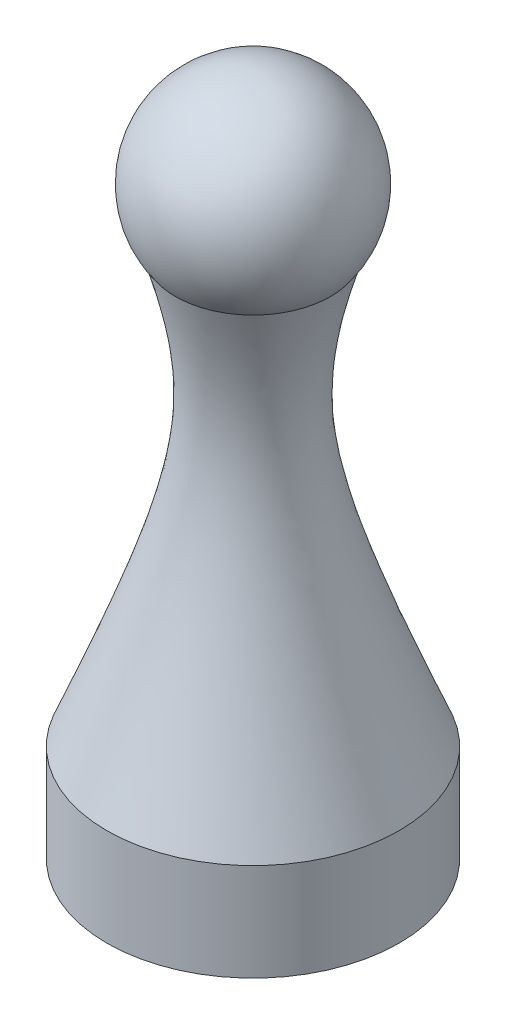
ISO-10303-21;
HEADER;
FILE_DESCRIPTION(('STEP AP214'),'2;1');
FILE_NAME('part.step','',(''),(''),'','','');
FILE_SCHEMA(('AUTOMOTIVE_DESIGN { 1 0 10303 214 1 1 1 1 }'));
ENDSEC;
DATA;
#1=APPLICATION_CONTEXT('core data for automotive mechanical design processes');
#2=APPLICATION_PROTOCOL_DEFINITION('international standard','automotive_design',2000,#1);
#3=PRODUCT_CONTEXT('',#1,'mechanical');
#4=PRODUCT('Part','Part','',(#3));
#5=PRODUCT_RELATED_PRODUCT_CATEGORY('part','',(#4));
#6=PRODUCT_DEFINITION_FORMATION('','',#4);
#7=PRODUCT_DEFINITION_CONTEXT('part definition',#1,'design');
#8=PRODUCT_DEFINITION('design','',#6,#7);
#9=PRODUCT_DEFINITION_SHAPE('','',#8);
#10=(LENGTH_UNIT() NAMED_UNIT(*) SI_UNIT(.MILLI.,.METRE.));
#11=(NAMED_UNIT(*) PLANE_ANGLE_UNIT() SI_UNIT($,.RADIAN.));
#12=(NAMED_UNIT(*) SI_UNIT($,.STERADIAN.) SOLID_ANGLE_UNIT());
#13=UNCERTAINTY_MEASURE_WITH_UNIT(LENGTH_MEASURE(1.E-05),#10,'distance_accuracy_value','');
#14=(GEOMETRIC_REPRESENTATION_CONTEXT(3) GLOBAL_UNCERTAINTY_ASSIGNED_CONTEXT((#13)) GLOBAL_UNIT_ASSIGNED_CONTEXT((#10,
#11,#12)) REPRESENTATION_CONTEXT('',''));
#15=CARTESIAN_POINT('',(0.,0.,0.));
#16=DIRECTION('',(0.,0.,1.));
#17=DIRECTION('',(1.,0.,0.));
#18=AXIS2_PLACEMENT_3D('',#15,#16,#17);
#19=CARTESIAN_POINT('',(-8.44327925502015,60.,-5.35826794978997));
#20=CARTESIAN_POINT('',(0.,10.,15.));
#21=CARTESIAN_POINT('',(2.27325664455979,60.,-22.2448264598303));
#22=CARTESIAN_POINT('',(-30.,10.,15.));
#23=CARTESIAN_POINT('',(19.1598151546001,60.,-11.5282905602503));
#24=CARTESIAN_POINT('',(-30.,10.,-15.));
#25=CARTESIAN_POINT('',(8.44327925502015,60.,5.35826794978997));
#26=CARTESIAN_POINT('',(0.,10.,-15.));
#27=CARTESIAN_POINT('',(-2.27325664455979,60.,22.2448264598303));
#28=CARTESIAN_POINT('',(30.,10.,-15.));
#29=CARTESIAN_POINT('',(-19.1598151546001,60.,11.5282905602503));
#30=CARTESIAN_POINT('',(30.,10.,15.));
#31=CARTESIAN_POINT('',(-8.44327925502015,60.,-5.35826794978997));
#32=CARTESIAN_POINT('',(0.,10.,15.));
#33=(BOUNDED_SURFACE() B_SPLINE_SURFACE(3,1,((#19,#20),(#21,#22),(#23,#24),(#25,#26),(#27,#28),
(#29,#30),(#31,#32)),.UNSPECIFIED.,.T.,.F.,.F.) B_SPLINE_SURFACE_WITH_KNOTS((4,3,4),(2,2),(0.,
0.5,1.),(0.,1.),.UNSPECIFIED.) GEOMETRIC_REPRESENTATION_ITEM() RATIONAL_B_SPLINE_SURFACE(((1.,
1.),(0.333333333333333,0.333333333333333),(0.333333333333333,0.333333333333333),(1.,1.),
(0.333333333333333,0.333333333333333),(0.333333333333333,0.333333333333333),(1.,1.))) REPRESENTATION_ITEM('') SURFACE());
#34=CARTESIAN_POINT('',(0.,10.,0.));
#35=DIRECTION('',(0.,-1.,0.));
#36=DIRECTION('',(0.,0.,-1.));
#37=AXIS2_PLACEMENT_3D('',#34,#35,#36);
#38=CIRCLE('',#37,15.);
#39=CARTESIAN_POINT('',(0.,10.,15.));
#40=VERTEX_POINT('',#39);
#41=EDGE_CURVE('E12',#40,#40,#38,.F.);
#42=CARTESIAN_POINT('',(0.,53.9588331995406,0.));
#43=DIRECTION('',(0.,-1.,0.));
#44=DIRECTION('',(0.,0.,-1.));
#45=AXIS2_PLACEMENT_3D('',#42,#43,#44);
#46=CIRCLE('',#45,7.9689587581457);
#47=CARTESIAN_POINT('',(-7.42313408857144,53.9588331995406,-2.89851410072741));
#48=VERTEX_POINT('',#47);
#49=EDGE_CURVE('E165',#48,#48,#46,.T.);
#50=CARTESIAN_POINT('',(0.,10.,15.));
#51=CARTESIAN_POINT('',(-0.0773243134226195,10.4579045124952,14.8135571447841));
#52=CARTESIAN_POINT('',(-0.154648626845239,10.9158090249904,14.6271142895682));
#53=CARTESIAN_POINT('',(-0.309297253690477,11.8316180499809,14.2542285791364));
#54=CARTESIAN_POINT('',(-0.386621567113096,12.2895225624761,14.0677857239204));
#55=CARTESIAN_POINT('',(-0.541270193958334,13.2053315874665,13.6949000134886));
#56=CARTESIAN_POINT('',(-0.618594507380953,13.6632360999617,13.5084571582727));
#57=CARTESIAN_POINT('',(-0.773243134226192,14.5790451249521,13.1355714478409));
#58=CARTESIAN_POINT('',(-0.850567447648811,15.0369496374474,12.949128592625));
#59=CARTESIAN_POINT('',(-1.00521607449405,15.9527586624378,12.5762428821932));
#60=CARTESIAN_POINT('',(-1.08254038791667,16.410663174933,12.3898000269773));
#61=CARTESIAN_POINT('',(-1.23718901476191,17.3264721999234,12.0169143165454));
#62=CARTESIAN_POINT('',(-1.31451332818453,17.7843767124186,11.8304714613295));
#63=CARTESIAN_POINT('',(-1.46916195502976,18.7001857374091,11.4575857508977));
#64=CARTESIAN_POINT('',(-1.54648626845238,19.1580902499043,11.2711428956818));
#65=CARTESIAN_POINT('',(-1.70113489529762,20.0738992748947,10.89825718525));
#66=CARTESIAN_POINT('',(-1.77845920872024,20.5318037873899,10.7118143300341));
#67=CARTESIAN_POINT('',(-1.93310783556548,21.4476128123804,10.3389286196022));
#68=CARTESIAN_POINT('',(-2.0104321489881,21.9055173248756,10.1524857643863));
#69=CARTESIAN_POINT('',(-2.16508077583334,22.821326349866,9.77960005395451));
#70=CARTESIAN_POINT('',(-2.24240508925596,23.2792308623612,9.5931571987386));
#71=CARTESIAN_POINT('',(-2.39705371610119,24.1950398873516,9.22027148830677));
#72=CARTESIAN_POINT('',(-2.47437802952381,24.6529443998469,9.03382863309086));
#73=CARTESIAN_POINT('',(-2.62902665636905,25.5687534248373,8.66094292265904));
#74=CARTESIAN_POINT('',(-2.70635096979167,26.0266579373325,8.47450006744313));
#75=CARTESIAN_POINT('',(-2.86099959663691,26.9424669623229,8.10161435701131));
#76=CARTESIAN_POINT('',(-2.93832391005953,27.4003714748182,7.9151715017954));
#77=CARTESIAN_POINT('',(-3.09297253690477,28.3161804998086,7.54228579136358));
#78=CARTESIAN_POINT('',(-3.17029685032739,28.7740850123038,7.35584293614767));
#79=CARTESIAN_POINT('',(-3.32494547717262,29.6898940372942,6.98295722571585));
#80=CARTESIAN_POINT('',(-3.40226979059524,30.1477985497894,6.79651437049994));
#81=CARTESIAN_POINT('',(-3.55691841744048,31.0636075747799,6.42362866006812));
#82=CARTESIAN_POINT('',(-3.6342427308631,31.5215120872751,6.2371858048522));
#83=CARTESIAN_POINT('',(-3.78889135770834,32.4373211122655,5.86430009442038));
#84=CARTESIAN_POINT('',(-3.86621567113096,32.8952256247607,5.67785723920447));
#85=CARTESIAN_POINT('',(-4.0208642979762,33.8110346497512,5.30497152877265));
#86=CARTESIAN_POINT('',(-4.09818861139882,34.2689391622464,5.11852867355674));
#87=CARTESIAN_POINT('',(-4.25283723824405,35.1847481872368,4.74564296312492));
#88=CARTESIAN_POINT('',(-4.33016155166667,35.642652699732,4.55920010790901));
#89=CARTESIAN_POINT('',(-4.48481017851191,36.5584617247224,4.18631439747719));
#90=CARTESIAN_POINT('',(-4.56213449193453,37.0163662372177,3.99987154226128));
#91=CARTESIAN_POINT('',(-4.71678311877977,37.9321752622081,3.62698583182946));
#92=CARTESIAN_POINT('',(-4.79410743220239,38.3900797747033,3.44054297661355));
#93=CARTESIAN_POINT('',(-4.94875605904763,39.3058887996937,3.06765726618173));
#94=CARTESIAN_POINT('',(-5.02608037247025,39.7637933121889,2.88121441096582));
#95=CARTESIAN_POINT('',(-5.18072899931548,40.6796023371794,2.50832870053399));
#96=CARTESIAN_POINT('',(-5.2580533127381,41.1375068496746,2.32188584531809));
#97=CARTESIAN_POINT('',(-5.41270193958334,42.053315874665,1.94900013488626));
#98=CARTESIAN_POINT('',(-5.49002625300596,42.5112203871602,1.76255727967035));
#99=CARTESIAN_POINT('',(-5.6446748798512,43.4270294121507,1.38967156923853));
#100=CARTESIAN_POINT('',(-5.72199919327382,43.8849339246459,1.20322871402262));
#101=CARTESIAN_POINT('',(-5.87664782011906,44.8007429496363,0.8303430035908));
#102=CARTESIAN_POINT('',(-5.95397213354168,45.2586474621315,0.643900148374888));
#103=CARTESIAN_POINT('',(-6.10862076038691,46.1744564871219,0.271014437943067));
#104=CARTESIAN_POINT('',(-6.18594507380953,46.6323609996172,0.0845715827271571));
#105=CARTESIAN_POINT('',(-6.34059370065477,47.5481700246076,-0.288314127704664));
#106=CARTESIAN_POINT('',(-6.41791801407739,48.0060745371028,-0.474756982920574));
#107=CARTESIAN_POINT('',(-6.57256664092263,48.9218835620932,-0.847642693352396));
#108=CARTESIAN_POINT('',(-6.64989095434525,49.3797880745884,-1.03408554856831));
#109=CARTESIAN_POINT('',(-6.80453958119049,50.2955970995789,-1.40697125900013));
#110=CARTESIAN_POINT('',(-6.88186389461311,50.7535016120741,-1.59341411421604));
#111=CARTESIAN_POINT('',(-7.03651252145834,51.6693106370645,-1.96629982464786));
#112=CARTESIAN_POINT('',(-7.11383683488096,52.1272151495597,-2.15274267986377));
#113=CARTESIAN_POINT('',(-7.2684854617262,53.0430241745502,-2.52562839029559));
#114=CARTESIAN_POINT('',(-7.34580977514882,53.5009286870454,-2.7120712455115));
#115=CARTESIAN_POINT('',(-7.42313408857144,53.9588331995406,-2.89851410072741));
#116=B_SPLINE_CURVE_WITH_KNOTS('',3,(#50,#51,#52,#53,#54,#55,#56,#57,#58,#59,#60,#61,#62,#63,
#64,#65,#66,#67,#68,#69,#70,#71,#72,#73,#74,#75,#76,#77,#78,#79,#80,#81,#82,#83,#84,#85,#86,#87,
#88,#89,#90,#91,#92,#93,#94,#95,#96,#97,#98,#99,#100,#101,#102,#103,#104,#105,#106,#107,#108,
#109,#110,#111,#112,#113,#114,#115),.UNSPECIFIED.,.F.,.F.,(4,2,2,2,2,2,2,2,2,2,2,2,2,2,2,2,2,2,
2,2,2,2,2,2,2,2,2,2,2,2,2,2,4),(0.,1.50124907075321,3.00249814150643,4.50374721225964,
6.00499628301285,7.50624535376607,9.00749442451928,10.5087434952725,12.0099925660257,
13.5112416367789,15.0124907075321,16.5137397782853,18.0149888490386,19.5162379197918,
21.017486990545,22.5187360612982,24.0199851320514,25.5212342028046,27.0224832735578,
28.523732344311,30.0249814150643,31.5262304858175,33.0274795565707,34.5287286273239,
36.0299776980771,37.5312267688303,39.0324758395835,40.5337249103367,42.0349739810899,
43.5362230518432,45.0374721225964,46.5387211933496,48.0399702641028),.UNSPECIFIED.);
#117=EDGE_CURVE('BSEAM161',#40,#48,#116,.T.);
#118=ORIENTED_EDGE('',*,*,#41,.T.);
#119=ORIENTED_EDGE('',*,*,#49,.T.);
#120=ORIENTED_EDGE('',*,*,#117,.T.);
#121=ORIENTED_EDGE('',*,*,#117,.F.);
#122=EDGE_LOOP('',(#118,#120,#119,#121));
#123=FACE_BOUND('',#122,.T.);
#124=ADVANCED_FACE('F161',(#123),#33,.T.);
#125=CARTESIAN_POINT('',(0.,10.,0.));
#126=DIRECTION('',(0.,-1.,0.));
#127=DIRECTION('',(0.,0.,-1.));
#128=AXIS2_PLACEMENT_3D('',#125,#126,#127);
#129=CYLINDRICAL_SURFACE('',#128,15.);
#130=ORIENTED_EDGE('',*,*,#41,.F.);
#131=EDGE_LOOP('',(#130));
#132=FACE_BOUND('',#131,.T.);
#133=CARTESIAN_POINT('',(0.,0.,0.));
#134=DIRECTION('',(0.,1.,0.));
#135=DIRECTION('',(0.,0.,1.));
#136=AXIS2_PLACEMENT_3D('',#133,#134,#135);
#137=CIRCLE('',#136,15.);
#138=CARTESIAN_POINT('',(0.,0.,15.));
#139=VERTEX_POINT('',#138);
#140=EDGE_CURVE('E170',#139,#139,#137,.T.);
#141=ORIENTED_EDGE('',*,*,#140,.T.);
#142=EDGE_LOOP('',(#141));
#143=FACE_BOUND('',#142,.T.);
#144=ADVANCED_FACE('F163',(#132,#143),#129,.T.);
#145=CARTESIAN_POINT('',(0.,0.,0.));
#146=DIRECTION('',(0.,1.,0.));
#147=DIRECTION('',(0.,0.,1.));
#148=AXIS2_PLACEMENT_3D('',#145,#146,#147);
#149=PLANE('',#148);
#150=DIRECTION('',(-0.365433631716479,0.,-0.93083739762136));
#151=VECTOR('',#150,1.);
#152=CARTESIAN_POINT('',(-3.84697849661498,0.,1.51026949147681));
#153=LINE('',#152,#151);
#154=CARTESIAN_POINT('',(-0.950626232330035,0.,8.88789642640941));
#155=VERTEX_POINT('',#154);
#156=CARTESIAN_POINT('',(-5.20694869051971,0.,-1.95386463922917));
#157=VERTEX_POINT('',#156);
#158=EDGE_CURVE('E403',#155,#157,#153,.T.);
#159=ORIENTED_EDGE('',*,*,#158,.F.);
#160=CARTESIAN_POINT('',(-1.4866757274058,0.,2.65930278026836));
#161=DIRECTION('',(0.,-1.,0.));
#162=DIRECTION('',(0.,0.,-1.));
#163=AXIS2_PLACEMENT_3D('',#160,#161,#162);
#164=CIRCLE('',#163,6.25161802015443);
#165=CARTESIAN_POINT('',(-7.72804018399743,0.,2.30139554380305));
#166=VERTEX_POINT('',#165);
#167=EDGE_CURVE('E401',#155,#166,#164,.F.);
#168=ORIENTED_EDGE('',*,*,#167,.T.);
#169=CARTESIAN_POINT('',(-1.77371629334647,0.,2.95466336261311));
#170=DIRECTION('',(0.,-1.,0.));
#171=DIRECTION('',(0.,0.,-1.));
#172=AXIS2_PLACEMENT_3D('',#169,#170,#171);
#173=CIRCLE('',#172,5.99005274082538);
#174=EDGE_CURVE('E370',#157,#166,#173,.F.);
#175=ORIENTED_EDGE('',*,*,#174,.F.);
#176=EDGE_LOOP('',(#159,#168,#175));
#177=FACE_BOUND('',#176,.T.);
#178=CARTESIAN_POINT('',(-0.842610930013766,0.,2.13445317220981));
#179=DIRECTION('',(0.,-1.,0.));
#180=DIRECTION('',(0.,0.,-1.));
#181=AXIS2_PLACEMENT_3D('',#178,#179,#180);
#182=CIRCLE('',#181,7.17483581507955);
#183=CARTESIAN_POINT('',(0.151933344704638,0.,9.2400249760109));
#184=VERTEX_POINT('',#183);
#185=CARTESIAN_POINT('',(-7.72804018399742,0.,0.117243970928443));
#186=VERTEX_POINT('',#185);
#187=EDGE_CURVE('E463',#184,#186,#182,.F.);
#188=ORIENTED_EDGE('',*,*,#187,.F.);
#189=CARTESIAN_POINT('',(0.783534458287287,0.,0.729839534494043));
#190=DIRECTION('',(0.,-1.,0.));
#191=DIRECTION('',(0.,0.,-1.));
#192=AXIS2_PLACEMENT_3D('',#189,#190,#191);
#193=CIRCLE('',#192,8.53359105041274);
#194=CARTESIAN_POINT('',(6.33222488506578,0.,-5.75354004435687));
#195=VERTEX_POINT('',#194);
#196=EDGE_CURVE('E416',#184,#195,#193,.F.);
#197=ORIENTED_EDGE('',*,*,#196,.T.);
#198=DIRECTION('',(-0.842101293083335,0.,0.539319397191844));
#199=VECTOR('',#198,1.);
#200=CARTESIAN_POINT('',(-0.771211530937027,0.,-1.20418110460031));
#201=LINE('',#200,#199);
#202=CARTESIAN_POINT('',(8.83526426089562,0.,-7.3565986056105));
#203=VERTEX_POINT('',#202);
#204=EDGE_CURVE('E437',#203,#195,#201,.T.);
#205=ORIENTED_EDGE('',*,*,#204,.F.);
#206=DIRECTION('',(0.,0.,1.));
#207=VECTOR('',#206,1.);
#208=CARTESIAN_POINT('',(8.83526426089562,0.,0.));
#209=LINE('',#208,#207);
#210=CARTESIAN_POINT('',(8.83526426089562,0.,-7.80361311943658));
#211=VERTEX_POINT('',#210);
#212=EDGE_CURVE('E492',#211,#203,#209,.T.);
#213=ORIENTED_EDGE('',*,*,#212,.F.);
#214=DIRECTION('',(1.,0.,0.));
#215=VECTOR('',#214,1.);
#216=CARTESIAN_POINT('',(0.,0.,-7.80361311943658));
#217=LINE('',#216,#215);
#218=CARTESIAN_POINT('',(4.39823128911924,0.,-7.80361311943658));
#219=VERTEX_POINT('',#218);
#220=EDGE_CURVE('E489',#219,#211,#217,.T.);
#221=ORIENTED_EDGE('',*,*,#220,.F.);
#222=DIRECTION('',(-0.205904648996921,0.,-0.978572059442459));
#223=VECTOR('',#222,1.);
#224=CARTESIAN_POINT('',(5.7841304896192,0.,-1.21705841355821));
#225=LINE('',#224,#223);
#226=CARTESIAN_POINT('',(4.58634695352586,0.,-6.90958409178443));
#227=VERTEX_POINT('',#226);
#228=EDGE_CURVE('E486',#227,#219,#225,.T.);
#229=ORIENTED_EDGE('',*,*,#228,.F.);
#230=CARTESIAN_POINT('',(-3.65651739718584,0.,-6.55769199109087));
#231=VERTEX_POINT('',#230);
#232=EDGE_CURVE('E464',#227,#231,#193,.F.);
#233=ORIENTED_EDGE('',*,*,#232,.T.);
#234=DIRECTION('',(0.110212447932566,0.,0.993908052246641));
#235=VECTOR('',#234,1.);
#236=CARTESIAN_POINT('',(-2.89376607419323,0.,0.32088385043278));
#237=LINE('',#236,#235);
#238=CARTESIAN_POINT('',(-3.7830585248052,0.,-7.69885388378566));
#239=VERTEX_POINT('',#238);
#240=EDGE_CURVE('E483',#239,#231,#237,.T.);
#241=ORIENTED_EDGE('',*,*,#240,.F.);
#242=DIRECTION('',(0.,0.,1.));
#243=VECTOR('',#242,1.);
#244=CARTESIAN_POINT('',(-3.7830585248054,0.,0.));
#245=LINE('',#244,#243);
#246=CARTESIAN_POINT('',(-3.78305852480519,0.,-7.93892706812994));
#247=VERTEX_POINT('',#246);
#248=EDGE_CURVE('E480',#247,#239,#245,.T.);
#249=ORIENTED_EDGE('',*,*,#248,.F.);
#250=DIRECTION('',(1.,0.,0.));
#251=VECTOR('',#250,1.);
#252=CARTESIAN_POINT('',(0.,0.,-7.93892706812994));
#253=LINE('',#252,#251);
#254=CARTESIAN_POINT('',(-9.12138739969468,0.,-7.93892706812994));
#255=VERTEX_POINT('',#254);
#256=EDGE_CURVE('E477',#255,#247,#253,.T.);
#257=ORIENTED_EDGE('',*,*,#256,.F.);
#258=DIRECTION('',(0.,0.,-1.));
#259=VECTOR('',#258,1.);
#260=CARTESIAN_POINT('',(-9.12138739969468,0.,0.));
#261=LINE('',#260,#259);
#262=CARTESIAN_POINT('',(-9.12138739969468,0.,-7.45839873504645));
#263=VERTEX_POINT('',#262);
#264=EDGE_CURVE('E474',#263,#255,#261,.T.);
#265=ORIENTED_EDGE('',*,*,#264,.F.);
#266=DIRECTION('',(-0.793878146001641,0.,-0.60807687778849));
#267=VECTOR('',#266,1.);
#268=CARTESIAN_POINT('',(0.227758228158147,0.,-0.29735102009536));
#269=LINE('',#268,#267);
#270=CARTESIAN_POINT('',(-6.61395636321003,0.,-5.53781326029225));
#271=VERTEX_POINT('',#270);
#272=EDGE_CURVE('E471',#271,#263,#269,.T.);
#273=ORIENTED_EDGE('',*,*,#272,.F.);
#274=DIRECTION('',(-0.365433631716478,0.,-0.93083739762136));
#275=VECTOR('',#274,1.);
#276=CARTESIAN_POINT('',(-3.84697849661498,0.,1.51026949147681));
#277=LINE('',#276,#275);
#278=CARTESIAN_POINT('',(-6.12175120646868,0.,-4.28406175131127));
#279=VERTEX_POINT('',#278);
#280=EDGE_CURVE('E468',#279,#271,#277,.T.);
#281=ORIENTED_EDGE('',*,*,#280,.F.);
#282=EDGE_CURVE('E465',#279,#186,#193,.F.);
#283=ORIENTED_EDGE('',*,*,#282,.T.);
#284=EDGE_LOOP('',(#188,#197,#205,#213,#221,#229,#233,#241,#249,#257,#265,#273,#281,#283));
#285=FACE_BOUND('',#284,.T.);
#286=ORIENTED_EDGE('',*,*,#140,.F.);
#287=EDGE_LOOP('',(#286));
#288=FACE_BOUND('',#287,.T.);
#289=ADVANCED_FACE('F549',(#177,#285,#288),#149,.F.);
#290=CARTESIAN_POINT('',(0.,60.,0.));
#291=DIRECTION('',(0.,0.,-1.));
#292=DIRECTION('',(1.,0.,0.));
#293=AXIS2_PLACEMENT_3D('',#290,#291,#292);
#294=SPHERICAL_SURFACE('',#293,10.);
#295=CARTESIAN_POINT('',(0.,60.,0.));
#296=DIRECTION('',(0.,-1.,0.));
#297=DIRECTION('',(0.,0.,-1.));
#298=AXIS2_PLACEMENT_3D('',#295,#296,#297);
#299=SPHERICAL_SURFACE('',#298,10.);
#300=ORIENTED_EDGE('',*,*,#49,.F.);
#301=EDGE_LOOP('',(#300));
#302=FACE_BOUND('',#301,.T.);
#303=ADVANCED_FACE('F546',(#302),#299,.T.);
#304=CARTESIAN_POINT('',(0.783534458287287,-2.,0.729839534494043));
#305=DIRECTION('',(0.,1.,0.));
#306=DIRECTION('',(0.,0.,1.));
#307=AXIS2_PLACEMENT_3D('',#304,#305,#306);
#308=CYLINDRICAL_SURFACE('',#307,8.53359105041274);
#309=ORIENTED_EDGE('',*,*,#196,.F.);
#310=DIRECTION('',(0.,1.,0.));
#311=VECTOR('',#310,1.);
#312=CARTESIAN_POINT('',(0.151933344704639,-2.,9.2400249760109));
#313=LINE('',#312,#311);
#314=CARTESIAN_POINT('',(0.151933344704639,-2.,9.2400249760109));
#315=VERTEX_POINT('',#314);
#316=EDGE_CURVE('E535',#315,#184,#313,.T.);
#317=ORIENTED_EDGE('',*,*,#316,.F.);
#318=CARTESIAN_POINT('',(0.783534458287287,-2.,0.729839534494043));
#319=DIRECTION('',(0.,-1.,0.));
#320=DIRECTION('',(0.,0.,-1.));
#321=AXIS2_PLACEMENT_3D('',#318,#319,#320);
#322=CIRCLE('',#321,8.53359105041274);
#323=CARTESIAN_POINT('',(6.33222488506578,-2.,-5.75354004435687));
#324=VERTEX_POINT('',#323);
#325=EDGE_CURVE('E433',#315,#324,#322,.F.);
#326=ORIENTED_EDGE('',*,*,#325,.T.);
#327=DIRECTION('',(0.,1.,0.));
#328=VECTOR('',#327,1.);
#329=CARTESIAN_POINT('',(6.33222488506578,-2.,-5.75354004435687));
#330=LINE('',#329,#328);
#331=EDGE_CURVE('E461',#324,#195,#330,.T.);
#332=ORIENTED_EDGE('',*,*,#331,.T.);
#333=EDGE_LOOP('',(#309,#317,#326,#332));
#334=FACE_BOUND('',#333,.T.);
#335=ADVANCED_FACE('F548',(#334),#308,.T.);
#336=CARTESIAN_POINT('',(-0.842610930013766,-2.,2.13445317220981));
#337=DIRECTION('',(0.,1.,0.));
#338=DIRECTION('',(0.,0.,1.));
#339=AXIS2_PLACEMENT_3D('',#336,#337,#338);
#340=CYLINDRICAL_SURFACE('',#339,7.17483581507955);
#341=ORIENTED_EDGE('',*,*,#187,.T.);
#342=DIRECTION('',(0.,1.,0.));
#343=VECTOR('',#342,1.);
#344=CARTESIAN_POINT('',(-7.72804018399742,-2.,0.117243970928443));
#345=LINE('',#344,#343);
#346=CARTESIAN_POINT('',(-7.72804018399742,-2.,0.117243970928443));
#347=VERTEX_POINT('',#346);
#348=EDGE_CURVE('E532',#347,#186,#345,.T.);
#349=ORIENTED_EDGE('',*,*,#348,.F.);
#350=CARTESIAN_POINT('',(-0.842610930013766,-2.,2.13445317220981));
#351=DIRECTION('',(0.,-1.,0.));
#352=DIRECTION('',(0.,0.,-1.));
#353=AXIS2_PLACEMENT_3D('',#350,#351,#352);
#354=CIRCLE('',#353,7.17483581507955);
#355=EDGE_CURVE('E436',#315,#347,#354,.F.);
#356=ORIENTED_EDGE('',*,*,#355,.F.);
#357=ORIENTED_EDGE('',*,*,#316,.T.);
#358=EDGE_LOOP('',(#341,#349,#356,#357));
#359=FACE_BOUND('',#358,.T.);
#360=ADVANCED_FACE('F556',(#359),#340,.F.);
#361=ORIENTED_EDGE('',*,*,#282,.F.);
#362=DIRECTION('',(0.,1.,0.));
#363=VECTOR('',#362,1.);
#364=CARTESIAN_POINT('',(-6.12175120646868,-2.,-4.28406175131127));
#365=LINE('',#364,#363);
#366=CARTESIAN_POINT('',(-6.12175120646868,-2.,-4.28406175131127));
#367=VERTEX_POINT('',#366);
#368=EDGE_CURVE('E529',#367,#279,#365,.T.);
#369=ORIENTED_EDGE('',*,*,#368,.F.);
#370=EDGE_CURVE('E439',#367,#347,#322,.F.);
#371=ORIENTED_EDGE('',*,*,#370,.T.);
#372=ORIENTED_EDGE('',*,*,#348,.T.);
#373=EDGE_LOOP('',(#361,#369,#371,#372));
#374=FACE_BOUND('',#373,.T.);
#375=ADVANCED_FACE('F559',(#374),#308,.T.);
#376=CARTESIAN_POINT('',(-3.84697849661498,-2.,1.51026949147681));
#377=DIRECTION('',(0.93083739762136,0.,-0.365433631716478));
#378=DIRECTION('',(-0.365433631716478,0.,-0.93083739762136));
#379=AXIS2_PLACEMENT_3D('',#376,#377,#378);
#380=PLANE('',#379);
#381=ORIENTED_EDGE('',*,*,#280,.T.);
#382=DIRECTION('',(0.,1.,0.));
#383=VECTOR('',#382,1.);
#384=CARTESIAN_POINT('',(-6.61395636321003,-2.,-5.53781326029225));
#385=LINE('',#384,#383);
#386=CARTESIAN_POINT('',(-6.61395636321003,-2.,-5.53781326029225));
#387=VERTEX_POINT('',#386);
#388=EDGE_CURVE('E526',#387,#271,#385,.T.);
#389=ORIENTED_EDGE('',*,*,#388,.F.);
#390=DIRECTION('',(-0.365433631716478,0.,-0.93083739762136));
#391=VECTOR('',#390,1.);
#392=CARTESIAN_POINT('',(-3.84697849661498,-2.,1.51026949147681));
#393=LINE('',#392,#391);
#394=EDGE_CURVE('E441',#367,#387,#393,.T.);
#395=ORIENTED_EDGE('',*,*,#394,.F.);
#396=ORIENTED_EDGE('',*,*,#368,.T.);
#397=EDGE_LOOP('',(#381,#389,#395,#396));
#398=FACE_BOUND('',#397,.T.);
#399=ADVANCED_FACE('F617',(#398),#380,.F.);
#400=CARTESIAN_POINT('',(0.227758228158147,-2.,-0.29735102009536));
#401=DIRECTION('',(0.60807687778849,0.,-0.793878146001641));
#402=DIRECTION('',(-0.793878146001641,0.,-0.60807687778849));
#403=AXIS2_PLACEMENT_3D('',#400,#401,#402);
#404=PLANE('',#403);
#405=ORIENTED_EDGE('',*,*,#272,.T.);
#406=DIRECTION('',(0.,1.,0.));
#407=VECTOR('',#406,1.);
#408=CARTESIAN_POINT('',(-9.12138739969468,-2.,-7.45839873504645));
#409=LINE('',#408,#407);
#410=CARTESIAN_POINT('',(-9.12138739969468,-2.,-7.45839873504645));
#411=VERTEX_POINT('',#410);
#412=EDGE_CURVE('E523',#411,#263,#409,.T.);
#413=ORIENTED_EDGE('',*,*,#412,.F.);
#414=DIRECTION('',(-0.793878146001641,0.,-0.60807687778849));
#415=VECTOR('',#414,1.);
#416=CARTESIAN_POINT('',(0.227758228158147,-2.,-0.29735102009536));
#417=LINE('',#416,#415);
#418=EDGE_CURVE('E443',#387,#411,#417,.T.);
#419=ORIENTED_EDGE('',*,*,#418,.F.);
#420=ORIENTED_EDGE('',*,*,#388,.T.);
#421=EDGE_LOOP('',(#405,#413,#419,#420));
#422=FACE_BOUND('',#421,.T.);
#423=ADVANCED_FACE('F627',(#422),#404,.F.);
#424=CARTESIAN_POINT('',(-9.12138739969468,-2.,0.));
#425=DIRECTION('',(1.,0.,0.));
#426=DIRECTION('',(0.,0.,-1.));
#427=AXIS2_PLACEMENT_3D('',#424,#425,#426);
#428=PLANE('',#427);
#429=ORIENTED_EDGE('',*,*,#264,.T.);
#430=DIRECTION('',(0.,1.,0.));
#431=VECTOR('',#430,1.);
#432=CARTESIAN_POINT('',(-9.12138739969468,-2.,-7.93892706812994));
#433=LINE('',#432,#431);
#434=CARTESIAN_POINT('',(-9.12138739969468,-2.,-7.93892706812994));
#435=VERTEX_POINT('',#434);
#436=EDGE_CURVE('E520',#435,#255,#433,.T.);
#437=ORIENTED_EDGE('',*,*,#436,.F.);
#438=DIRECTION('',(0.,0.,-1.));
#439=VECTOR('',#438,1.);
#440=CARTESIAN_POINT('',(-9.12138739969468,-2.,0.));
#441=LINE('',#440,#439);
#442=EDGE_CURVE('E445',#411,#435,#441,.T.);
#443=ORIENTED_EDGE('',*,*,#442,.F.);
#444=ORIENTED_EDGE('',*,*,#412,.T.);
#445=EDGE_LOOP('',(#429,#437,#443,#444));
#446=FACE_BOUND('',#445,.T.);
#447=ADVANCED_FACE('F638',(#446),#428,.F.);
#448=CARTESIAN_POINT('',(0.,-2.,-7.93892706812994));
#449=DIRECTION('',(0.,0.,1.));
#450=DIRECTION('',(1.,0.,0.));
#451=AXIS2_PLACEMENT_3D('',#448,#449,#450);
#452=PLANE('',#451);
#453=ORIENTED_EDGE('',*,*,#256,.T.);
#454=DIRECTION('',(0.,1.,0.));
#455=VECTOR('',#454,1.);
#456=CARTESIAN_POINT('',(-3.78305852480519,-2.,-7.93892706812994));
#457=LINE('',#456,#455);
#458=CARTESIAN_POINT('',(-3.78305852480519,-2.,-7.93892706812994));
#459=VERTEX_POINT('',#458);
#460=EDGE_CURVE('E517',#459,#247,#457,.T.);
#461=ORIENTED_EDGE('',*,*,#460,.F.);
#462=DIRECTION('',(1.,0.,0.));
#463=VECTOR('',#462,1.);
#464=CARTESIAN_POINT('',(0.,-2.,-7.93892706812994));
#465=LINE('',#464,#463);
#466=EDGE_CURVE('E447',#435,#459,#465,.T.);
#467=ORIENTED_EDGE('',*,*,#466,.F.);
#468=ORIENTED_EDGE('',*,*,#436,.T.);
#469=EDGE_LOOP('',(#453,#461,#467,#468));
#470=FACE_BOUND('',#469,.T.);
#471=ADVANCED_FACE('F649',(#470),#452,.F.);
#472=CARTESIAN_POINT('',(-3.7830585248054,-2.,0.));
#473=DIRECTION('',(-1.,0.,0.));
#474=DIRECTION('',(0.,0.,1.));
#475=AXIS2_PLACEMENT_3D('',#472,#473,#474);
#476=PLANE('',#475);
#477=ORIENTED_EDGE('',*,*,#248,.T.);
#478=DIRECTION('',(0.,1.,0.));
#479=VECTOR('',#478,1.);
#480=CARTESIAN_POINT('',(-3.7830585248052,-2.,-7.69885388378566));
#481=LINE('',#480,#479);
#482=CARTESIAN_POINT('',(-3.7830585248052,-2.,-7.69885388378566));
#483=VERTEX_POINT('',#482);
#484=EDGE_CURVE('E514',#483,#239,#481,.T.);
#485=ORIENTED_EDGE('',*,*,#484,.F.);
#486=DIRECTION('',(0.,0.,1.));
#487=VECTOR('',#486,1.);
#488=CARTESIAN_POINT('',(-3.7830585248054,-2.,0.));
#489=LINE('',#488,#487);
#490=EDGE_CURVE('E449',#459,#483,#489,.T.);
#491=ORIENTED_EDGE('',*,*,#490,.F.);
#492=ORIENTED_EDGE('',*,*,#460,.T.);
#493=EDGE_LOOP('',(#477,#485,#491,#492));
#494=FACE_BOUND('',#493,.T.);
#495=ADVANCED_FACE('F660',(#494),#476,.F.);
#496=CARTESIAN_POINT('',(-2.89376607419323,-2.,0.32088385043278));
#497=DIRECTION('',(-0.993908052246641,0.,0.110212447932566));
#498=DIRECTION('',(0.110212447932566,0.,0.993908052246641));
#499=AXIS2_PLACEMENT_3D('',#496,#497,#498);
#500=PLANE('',#499);
#501=ORIENTED_EDGE('',*,*,#240,.T.);
#502=DIRECTION('',(0.,1.,0.));
#503=VECTOR('',#502,1.);
#504=CARTESIAN_POINT('',(-3.65651739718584,-2.,-6.55769199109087));
#505=LINE('',#504,#503);
#506=CARTESIAN_POINT('',(-3.65651739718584,-2.,-6.55769199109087));
#507=VERTEX_POINT('',#506);
#508=EDGE_CURVE('E511',#507,#231,#505,.T.);
#509=ORIENTED_EDGE('',*,*,#508,.F.);
#510=DIRECTION('',(0.110212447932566,0.,0.993908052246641));
#511=VECTOR('',#510,1.);
#512=CARTESIAN_POINT('',(-2.89376607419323,-2.,0.32088385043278));
#513=LINE('',#512,#511);
#514=EDGE_CURVE('E451',#483,#507,#513,.T.);
#515=ORIENTED_EDGE('',*,*,#514,.F.);
#516=ORIENTED_EDGE('',*,*,#484,.T.);
#517=EDGE_LOOP('',(#501,#509,#515,#516));
#518=FACE_BOUND('',#517,.T.);
#519=ADVANCED_FACE('F671',(#518),#500,.F.);
#520=ORIENTED_EDGE('',*,*,#232,.F.);
#521=DIRECTION('',(0.,1.,0.));
#522=VECTOR('',#521,1.);
#523=CARTESIAN_POINT('',(4.58634695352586,-2.,-6.90958409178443));
#524=LINE('',#523,#522);
#525=CARTESIAN_POINT('',(4.58634695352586,-2.,-6.90958409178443));
#526=VERTEX_POINT('',#525);
#527=EDGE_CURVE('E508',#526,#227,#524,.T.);
#528=ORIENTED_EDGE('',*,*,#527,.F.);
#529=EDGE_CURVE('E438',#526,#507,#322,.F.);
#530=ORIENTED_EDGE('',*,*,#529,.T.);
#531=ORIENTED_EDGE('',*,*,#508,.T.);
#532=EDGE_LOOP('',(#520,#528,#530,#531));
#533=FACE_BOUND('',#532,.T.);
#534=ADVANCED_FACE('F560',(#533),#308,.T.);
#535=CARTESIAN_POINT('',(5.7841304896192,-2.,-1.21705841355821));
#536=DIRECTION('',(0.978572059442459,0.,-0.205904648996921));
#537=DIRECTION('',(-0.205904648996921,0.,-0.978572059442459));
#538=AXIS2_PLACEMENT_3D('',#535,#536,#537);
#539=PLANE('',#538);
#540=ORIENTED_EDGE('',*,*,#228,.T.);
#541=DIRECTION('',(0.,1.,0.));
#542=VECTOR('',#541,1.);
#543=CARTESIAN_POINT('',(4.39823128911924,-2.,-7.80361311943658));
#544=LINE('',#543,#542);
#545=CARTESIAN_POINT('',(4.39823128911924,-2.,-7.80361311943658));
#546=VERTEX_POINT('',#545);
#547=EDGE_CURVE('E505',#546,#219,#544,.T.);
#548=ORIENTED_EDGE('',*,*,#547,.F.);
#549=DIRECTION('',(-0.205904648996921,0.,-0.978572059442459));
#550=VECTOR('',#549,1.);
#551=CARTESIAN_POINT('',(5.7841304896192,-2.,-1.21705841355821));
#552=LINE('',#551,#550);
#553=EDGE_CURVE('E453',#526,#546,#552,.T.);
#554=ORIENTED_EDGE('',*,*,#553,.F.);
#555=ORIENTED_EDGE('',*,*,#527,.T.);
#556=EDGE_LOOP('',(#540,#548,#554,#555));
#557=FACE_BOUND('',#556,.T.);
#558=ADVANCED_FACE('F692',(#557),#539,.F.);
#559=CARTESIAN_POINT('',(0.,-2.,-7.80361311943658));
#560=DIRECTION('',(0.,0.,1.));
#561=DIRECTION('',(1.,0.,0.));
#562=AXIS2_PLACEMENT_3D('',#559,#560,#561);
#563=PLANE('',#562);
#564=ORIENTED_EDGE('',*,*,#220,.T.);
#565=DIRECTION('',(0.,1.,0.));
#566=VECTOR('',#565,1.);
#567=CARTESIAN_POINT('',(8.83526426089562,-2.,-7.80361311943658));
#568=LINE('',#567,#566);
#569=CARTESIAN_POINT('',(8.83526426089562,-2.,-7.80361311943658));
#570=VERTEX_POINT('',#569);
#571=EDGE_CURVE('E502',#570,#211,#568,.T.);
#572=ORIENTED_EDGE('',*,*,#571,.F.);
#573=DIRECTION('',(1.,0.,0.));
#574=VECTOR('',#573,1.);
#575=CARTESIAN_POINT('',(0.,-2.,-7.80361311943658));
#576=LINE('',#575,#574);
#577=EDGE_CURVE('E455',#546,#570,#576,.T.);
#578=ORIENTED_EDGE('',*,*,#577,.F.);
#579=ORIENTED_EDGE('',*,*,#547,.T.);
#580=EDGE_LOOP('',(#564,#572,#578,#579));
#581=FACE_BOUND('',#580,.T.);
#582=ADVANCED_FACE('F702',(#581),#563,.F.);
#583=CARTESIAN_POINT('',(8.83526426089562,-2.,0.));
#584=DIRECTION('',(-1.,0.,0.));
#585=DIRECTION('',(0.,0.,1.));
#586=AXIS2_PLACEMENT_3D('',#583,#584,#585);
#587=PLANE('',#586);
#588=ORIENTED_EDGE('',*,*,#212,.T.);
#589=DIRECTION('',(0.,1.,0.));
#590=VECTOR('',#589,1.);
#591=CARTESIAN_POINT('',(8.83526426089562,-2.,-7.3565986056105));
#592=LINE('',#591,#590);
#593=CARTESIAN_POINT('',(8.83526426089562,-2.,-7.3565986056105));
#594=VERTEX_POINT('',#593);
#595=EDGE_CURVE('E499',#594,#203,#592,.T.);
#596=ORIENTED_EDGE('',*,*,#595,.F.);
#597=DIRECTION('',(0.,0.,1.));
#598=VECTOR('',#597,1.);
#599=CARTESIAN_POINT('',(8.83526426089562,-2.,0.));
#600=LINE('',#599,#598);
#601=EDGE_CURVE('E457',#570,#594,#600,.T.);
#602=ORIENTED_EDGE('',*,*,#601,.F.);
#603=ORIENTED_EDGE('',*,*,#571,.T.);
#604=EDGE_LOOP('',(#588,#596,#602,#603));
#605=FACE_BOUND('',#604,.T.);
#606=ADVANCED_FACE('F713',(#605),#587,.F.);
#607=CARTESIAN_POINT('',(-0.771211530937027,-2.,-1.20418110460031));
#608=DIRECTION('',(-0.539319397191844,0.,-0.842101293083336));
#609=DIRECTION('',(-0.842101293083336,0.,0.539319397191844));
#610=AXIS2_PLACEMENT_3D('',#607,#608,#609);
#611=PLANE('',#610);
#612=ORIENTED_EDGE('',*,*,#204,.T.);
#613=ORIENTED_EDGE('',*,*,#331,.F.);
#614=DIRECTION('',(-0.842101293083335,0.,0.539319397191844));
#615=VECTOR('',#614,1.);
#616=CARTESIAN_POINT('',(-0.771211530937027,-2.,-1.20418110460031));
#617=LINE('',#616,#615);
#618=EDGE_CURVE('E459',#594,#324,#617,.T.);
#619=ORIENTED_EDGE('',*,*,#618,.F.);
#620=ORIENTED_EDGE('',*,*,#595,.T.);
#621=EDGE_LOOP('',(#612,#613,#619,#620));
#622=FACE_BOUND('',#621,.T.);
#623=ADVANCED_FACE('F724',(#622),#611,.F.);
#624=CARTESIAN_POINT('',(0.,-2.,0.));
#625=DIRECTION('',(0.,-1.,0.));
#626=DIRECTION('',(0.,0.,-1.));
#627=AXIS2_PLACEMENT_3D('',#624,#625,#626);
#628=PLANE('',#627);
#629=ORIENTED_EDGE('',*,*,#325,.F.);
#630=ORIENTED_EDGE('',*,*,#355,.T.);
#631=ORIENTED_EDGE('',*,*,#370,.F.);
#632=ORIENTED_EDGE('',*,*,#394,.T.);
#633=ORIENTED_EDGE('',*,*,#418,.T.);
#634=ORIENTED_EDGE('',*,*,#442,.T.);
#635=ORIENTED_EDGE('',*,*,#466,.T.);
#636=ORIENTED_EDGE('',*,*,#490,.T.);
#637=ORIENTED_EDGE('',*,*,#514,.T.);
#638=ORIENTED_EDGE('',*,*,#529,.F.);
#639=ORIENTED_EDGE('',*,*,#553,.T.);
#640=ORIENTED_EDGE('',*,*,#577,.T.);
#641=ORIENTED_EDGE('',*,*,#601,.T.);
#642=ORIENTED_EDGE('',*,*,#618,.T.);
#643=EDGE_LOOP('',(#629,#630,#631,#632,#633,#634,#635,#636,#637,#638,#639,#640,#641,#642));
#644=FACE_BOUND('',#643,.T.);
#645=ADVANCED_FACE('F735',(#644),#628,.T.);
#646=CARTESIAN_POINT('',(-1.4866757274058,-2.,2.65930278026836));
#647=DIRECTION('',(0.,1.,0.));
#648=DIRECTION('',(0.,0.,1.));
#649=AXIS2_PLACEMENT_3D('',#646,#647,#648);
#650=CYLINDRICAL_SURFACE('',#649,6.25161802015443);
#651=ORIENTED_EDGE('',*,*,#167,.F.);
#652=DIRECTION('',(0.,1.,0.));
#653=VECTOR('',#652,1.);
#654=CARTESIAN_POINT('',(-0.950626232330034,-2.,8.88789642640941));
#655=LINE('',#654,#653);
#656=CARTESIAN_POINT('',(-0.950626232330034,-2.,8.88789642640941));
#657=VERTEX_POINT('',#656);
#658=EDGE_CURVE('E413',#657,#155,#655,.T.);
#659=ORIENTED_EDGE('',*,*,#658,.F.);
#660=CARTESIAN_POINT('',(-1.4866757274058,-2.,2.65930278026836));
#661=DIRECTION('',(0.,-1.,0.));
#662=DIRECTION('',(0.,0.,-1.));
#663=AXIS2_PLACEMENT_3D('',#660,#661,#662);
#664=CIRCLE('',#663,6.25161802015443);
#665=CARTESIAN_POINT('',(-7.72804018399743,-2.,2.30139554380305));
#666=VERTEX_POINT('',#665);
#667=EDGE_CURVE('E381',#657,#666,#664,.F.);
#668=ORIENTED_EDGE('',*,*,#667,.T.);
#669=DIRECTION('',(0.,1.,0.));
#670=VECTOR('',#669,1.);
#671=CARTESIAN_POINT('',(-7.72804018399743,-2.,2.30139554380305));
#672=LINE('',#671,#670);
#673=EDGE_CURVE('E406',#666,#166,#672,.T.);
#674=ORIENTED_EDGE('',*,*,#673,.T.);
#675=EDGE_LOOP('',(#651,#659,#668,#674));
#676=FACE_BOUND('',#675,.T.);
#677=ADVANCED_FACE('F747',(#676),#650,.T.);
#678=CARTESIAN_POINT('',(-3.84697849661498,-2.,1.51026949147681));
#679=DIRECTION('',(0.93083739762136,0.,-0.365433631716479));
#680=DIRECTION('',(-0.365433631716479,0.,-0.93083739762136));
#681=AXIS2_PLACEMENT_3D('',#678,#679,#680);
#682=PLANE('',#681);
#683=ORIENTED_EDGE('',*,*,#158,.T.);
#684=DIRECTION('',(0.,1.,0.));
#685=VECTOR('',#684,1.);
#686=CARTESIAN_POINT('',(-5.20694869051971,-2.,-1.95386463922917));
#687=LINE('',#686,#685);
#688=CARTESIAN_POINT('',(-5.20694869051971,-2.,-1.95386463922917));
#689=VERTEX_POINT('',#688);
#690=EDGE_CURVE('E409',#689,#157,#687,.T.);
#691=ORIENTED_EDGE('',*,*,#690,.F.);
#692=DIRECTION('',(-0.365433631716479,0.,-0.93083739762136));
#693=VECTOR('',#692,1.);
#694=CARTESIAN_POINT('',(-3.84697849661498,-2.,1.51026949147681));
#695=LINE('',#694,#693);
#696=EDGE_CURVE('E384',#657,#689,#695,.T.);
#697=ORIENTED_EDGE('',*,*,#696,.F.);
#698=ORIENTED_EDGE('',*,*,#658,.T.);
#699=EDGE_LOOP('',(#683,#691,#697,#698));
#700=FACE_BOUND('',#699,.T.);
#701=ADVANCED_FACE('F758',(#700),#682,.F.);
#702=CARTESIAN_POINT('',(1.86824150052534,-2.,0.669970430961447));
#703=DIRECTION('',(0.941303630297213,0.,0.337561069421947));
#704=DIRECTION('',(0.337561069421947,0.,-0.941303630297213));
#705=AXIS2_PLACEMENT_3D('',#702,#703,#704);
#706=PLANE('',#705);
#707=DIRECTION('',(0.337561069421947,0.,-0.941303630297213));
#708=VECTOR('',#707,1.);
#709=CARTESIAN_POINT('',(1.86824150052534,0.,0.669970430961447));
#710=LINE('',#709,#708);
#711=CARTESIAN_POINT('',(0.0321582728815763,0.,5.78996786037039));
#712=VERTEX_POINT('',#711);
#713=CARTESIAN_POINT('',(2.53950586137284,0.,-1.20187924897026));
#714=VERTEX_POINT('',#713);
#715=EDGE_CURVE('E392',#712,#714,#710,.T.);
#716=ORIENTED_EDGE('',*,*,#715,.T.);
#717=DIRECTION('',(0.,1.,0.));
#718=VECTOR('',#717,1.);
#719=CARTESIAN_POINT('',(2.53950586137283,-2.,-1.20187924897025));
#720=LINE('',#719,#718);
#721=CARTESIAN_POINT('',(2.53950586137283,-2.,-1.20187924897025));
#722=VERTEX_POINT('',#721);
#723=EDGE_CURVE('E410',#722,#714,#720,.T.);
#724=ORIENTED_EDGE('',*,*,#723,.F.);
#725=DIRECTION('',(0.337561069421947,0.,-0.941303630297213));
#726=VECTOR('',#725,1.);
#727=CARTESIAN_POINT('',(1.86824150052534,-2.,0.669970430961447));
#728=LINE('',#727,#726);
#729=CARTESIAN_POINT('',(0.0321582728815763,-2.,5.78996786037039));
#730=VERTEX_POINT('',#729);
#731=EDGE_CURVE('E372',#730,#722,#728,.T.);
#732=ORIENTED_EDGE('',*,*,#731,.F.);
#733=DIRECTION('',(0.,1.,0.));
#734=VECTOR('',#733,1.);
#735=CARTESIAN_POINT('',(0.0321582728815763,-2.,5.78996786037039));
#736=LINE('',#735,#734);
#737=EDGE_CURVE('E417',#730,#712,#736,.T.);
#738=ORIENTED_EDGE('',*,*,#737,.T.);
#739=EDGE_LOOP('',(#716,#724,#732,#738));
#740=FACE_BOUND('',#739,.T.);
#741=ADVANCED_FACE('F769',(#740),#706,.F.);
#742=CARTESIAN_POINT('',(-1.77371629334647,-2.,2.95466336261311));
#743=DIRECTION('',(0.,1.,0.));
#744=DIRECTION('',(0.,0.,1.));
#745=AXIS2_PLACEMENT_3D('',#742,#743,#744);
#746=CYLINDRICAL_SURFACE('',#745,5.99005274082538);
#747=CARTESIAN_POINT('',(-3.24557238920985,0.,-2.8517444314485));
#748=VERTEX_POINT('',#747);
#749=EDGE_CURVE('E186',#714,#748,#173,.F.);
#750=ORIENTED_EDGE('',*,*,#749,.T.);
#751=DIRECTION('',(0.,1.,0.));
#752=VECTOR('',#751,1.);
#753=CARTESIAN_POINT('',(-3.24557238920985,-2.,-2.8517444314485));
#754=LINE('',#753,#752);
#755=CARTESIAN_POINT('',(-3.24557238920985,-2.,-2.8517444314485));
#756=VERTEX_POINT('',#755);
#757=EDGE_CURVE('E424',#756,#748,#754,.T.);
#758=ORIENTED_EDGE('',*,*,#757,.F.);
#759=CARTESIAN_POINT('',(-1.77371629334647,-2.,2.95466336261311));
#760=DIRECTION('',(0.,-1.,0.));
#761=DIRECTION('',(0.,0.,-1.));
#762=AXIS2_PLACEMENT_3D('',#759,#760,#761);
#763=CIRCLE('',#762,5.99005274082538);
#764=EDGE_CURVE('E374',#722,#756,#763,.F.);
#765=ORIENTED_EDGE('',*,*,#764,.F.);
#766=ORIENTED_EDGE('',*,*,#723,.T.);
#767=EDGE_LOOP('',(#750,#758,#765,#766));
#768=FACE_BOUND('',#767,.T.);
#769=ADVANCED_FACE('F780',(#768),#746,.F.);
#770=CARTESIAN_POINT('',(-2.89376607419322,-2.,0.320883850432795));
#771=DIRECTION('',(-0.99390805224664,0.,0.110212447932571));
#772=DIRECTION('',(0.110212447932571,0.,0.99390805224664));
#773=AXIS2_PLACEMENT_3D('',#770,#771,#772);
#774=PLANE('',#773);
#775=DIRECTION('',(0.110212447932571,0.,0.99390805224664));
#776=VECTOR('',#775,1.);
#777=CARTESIAN_POINT('',(-2.89376607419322,0.,0.320883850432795));
#778=LINE('',#777,#776);
#779=CARTESIAN_POINT('',(-3.20034941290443,0.,-2.4439186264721));
#780=VERTEX_POINT('',#779);
#781=EDGE_CURVE('E395',#748,#780,#778,.T.);
#782=ORIENTED_EDGE('',*,*,#781,.T.);
#783=DIRECTION('',(0.,1.,0.));
#784=VECTOR('',#783,1.);
#785=CARTESIAN_POINT('',(-3.20034941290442,-2.,-2.4439186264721));
#786=LINE('',#785,#784);
#787=CARTESIAN_POINT('',(-3.20034941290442,-2.,-2.4439186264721));
#788=VERTEX_POINT('',#787);
#789=EDGE_CURVE('E420',#788,#780,#786,.T.);
#790=ORIENTED_EDGE('',*,*,#789,.F.);
#791=DIRECTION('',(0.110212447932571,0.,0.99390805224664));
#792=VECTOR('',#791,1.);
#793=CARTESIAN_POINT('',(-2.89376607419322,-2.,0.320883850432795));
#794=LINE('',#793,#792);
#795=EDGE_CURVE('E377',#756,#788,#794,.T.);
#796=ORIENTED_EDGE('',*,*,#795,.F.);
#797=ORIENTED_EDGE('',*,*,#757,.T.);
#798=EDGE_LOOP('',(#782,#790,#796,#797));
#799=FACE_BOUND('',#798,.T.);
#800=ADVANCED_FACE('F791',(#799),#774,.F.);
#801=CARTESIAN_POINT('',(3.25776594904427,-2.,1.40010657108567));
#802=DIRECTION('',(-0.918744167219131,0.,-0.394853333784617));
#803=DIRECTION('',(-0.394853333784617,0.,0.918744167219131));
#804=AXIS2_PLACEMENT_3D('',#801,#802,#803);
#805=PLANE('',#804);
#806=DIRECTION('',(-0.394853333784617,0.,0.918744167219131));
#807=VECTOR('',#806,1.);
#808=CARTESIAN_POINT('',(3.25776594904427,0.,1.40010657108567));
#809=LINE('',#808,#807);
#810=CARTESIAN_POINT('',(3.66679962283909,0.,0.448367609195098));
#811=VERTEX_POINT('',#810);
#812=CARTESIAN_POINT('',(0.151933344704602,0.,8.62675339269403));
#813=VERTEX_POINT('',#812);
#814=EDGE_CURVE('E345',#811,#813,#809,.T.);
#815=ORIENTED_EDGE('',*,*,#814,.T.);
#816=DIRECTION('',(0.,1.,0.));
#817=VECTOR('',#816,1.);
#818=CARTESIAN_POINT('',(0.151933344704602,-2.,8.62675339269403));
#819=LINE('',#818,#817);
#820=CARTESIAN_POINT('',(0.151933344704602,-2.,8.62675339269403));
#821=VERTEX_POINT('',#820);
#822=EDGE_CURVE('E421',#821,#813,#819,.T.);
#823=ORIENTED_EDGE('',*,*,#822,.F.);
#824=DIRECTION('',(-0.394853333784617,0.,0.918744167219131));
#825=VECTOR('',#824,1.);
#826=CARTESIAN_POINT('',(3.25776594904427,-2.,1.40010657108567));
#827=LINE('',#826,#825);
#828=CARTESIAN_POINT('',(3.66679962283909,-2.,0.448367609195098));
#829=VERTEX_POINT('',#828);
#830=EDGE_CURVE('E366',#829,#821,#827,.T.);
#831=ORIENTED_EDGE('',*,*,#830,.F.);
#832=DIRECTION('',(0.,1.,0.));
#833=VECTOR('',#832,1.);
#834=CARTESIAN_POINT('',(3.66679962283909,-2.,0.448367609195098));
#835=LINE('',#834,#833);
#836=EDGE_CURVE('E428',#829,#811,#835,.T.);
#837=ORIENTED_EDGE('',*,*,#836,.T.);
#838=EDGE_LOOP('',(#815,#823,#831,#837));
#839=FACE_BOUND('',#838,.T.);
#840=ADVANCED_FACE('F804',(#839),#805,.F.);
#841=CARTESIAN_POINT('',(-1.94164755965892,-2.,0.762263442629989));
#842=DIRECTION('',(-0.93083739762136,0.,0.365433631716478));
#843=DIRECTION('',(0.365433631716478,0.,0.93083739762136));
#844=AXIS2_PLACEMENT_3D('',#841,#842,#843);
#845=PLANE('',#844);
#846=DIRECTION('',(0.365433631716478,0.,0.93083739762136));
#847=VECTOR('',#846,1.);
#848=CARTESIAN_POINT('',(-1.94164755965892,0.,0.762263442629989));
#849=LINE('',#848,#847);
#850=EDGE_CURVE('E398',#780,#712,#849,.T.);
#851=ORIENTED_EDGE('',*,*,#850,.T.);
#852=ORIENTED_EDGE('',*,*,#737,.F.);
#853=DIRECTION('',(0.365433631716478,0.,0.93083739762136));
#854=VECTOR('',#853,1.);
#855=CARTESIAN_POINT('',(-1.94164755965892,-2.,0.762263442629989));
#856=LINE('',#855,#854);
#857=EDGE_CURVE('E379',#788,#730,#856,.T.);
#858=ORIENTED_EDGE('',*,*,#857,.F.);
#859=ORIENTED_EDGE('',*,*,#789,.T.);
#860=EDGE_LOOP('',(#851,#852,#858,#859));
#861=FACE_BOUND('',#860,.T.);
#862=ADVANCED_FACE('F815',(#861),#845,.F.);
#863=EDGE_CURVE('E389',#813,#811,#173,.F.);
#864=ORIENTED_EDGE('',*,*,#863,.T.);
#865=ORIENTED_EDGE('',*,*,#836,.F.);
#866=EDGE_CURVE('E369',#821,#829,#763,.F.);
#867=ORIENTED_EDGE('',*,*,#866,.F.);
#868=ORIENTED_EDGE('',*,*,#822,.T.);
#869=EDGE_LOOP('',(#864,#865,#867,#868));
#870=FACE_BOUND('',#869,.T.);
#871=ADVANCED_FACE('F795',(#870),#746,.F.);
#872=ORIENTED_EDGE('',*,*,#174,.T.);
#873=ORIENTED_EDGE('',*,*,#673,.F.);
#874=EDGE_CURVE('E373',#689,#666,#763,.F.);
#875=ORIENTED_EDGE('',*,*,#874,.F.);
#876=ORIENTED_EDGE('',*,*,#690,.T.);
#877=EDGE_LOOP('',(#872,#873,#875,#876));
#878=FACE_BOUND('',#877,.T.);
#879=ADVANCED_FACE('F794',(#878),#746,.F.);
#880=CARTESIAN_POINT('',(0.,-2.,0.));
#881=DIRECTION('',(0.,-1.,0.));
#882=DIRECTION('',(0.,0.,-1.));
#883=AXIS2_PLACEMENT_3D('',#880,#881,#882);
#884=PLANE('',#883);
#885=ORIENTED_EDGE('',*,*,#830,.T.);
#886=ORIENTED_EDGE('',*,*,#866,.T.);
#887=EDGE_LOOP('',(#885,#886));
#888=FACE_BOUND('',#887,.T.);
#889=ORIENTED_EDGE('',*,*,#731,.T.);
#890=ORIENTED_EDGE('',*,*,#764,.T.);
#891=ORIENTED_EDGE('',*,*,#795,.T.);
#892=ORIENTED_EDGE('',*,*,#857,.T.);
#893=EDGE_LOOP('',(#889,#890,#891,#892));
#894=FACE_BOUND('',#893,.T.);
#895=ORIENTED_EDGE('',*,*,#667,.F.);
#896=ORIENTED_EDGE('',*,*,#696,.T.);
#897=ORIENTED_EDGE('',*,*,#874,.T.);
#898=EDGE_LOOP('',(#895,#896,#897));
#899=FACE_BOUND('',#898,.T.);
#900=ADVANCED_FACE('F845',(#888,#894,#899),#884,.T.);
#901=ORIENTED_EDGE('',*,*,#814,.F.);
#902=ORIENTED_EDGE('',*,*,#863,.F.);
#903=EDGE_LOOP('',(#901,#902));
#904=FACE_BOUND('',#903,.T.);
#905=ADVANCED_FACE('F564',(#904),#149,.F.);
#906=DIRECTION('',(-0.4571463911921,0.,0.889391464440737));
#907=VECTOR('',#906,1.);
#908=CARTESIAN_POINT('',(1.29524290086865,0.,0.665753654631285));
#909=LINE('',#908,#907);
#910=CARTESIAN_POINT('',(1.5771763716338,0.,0.117243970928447));
#911=VERTEX_POINT('',#910);
#912=CARTESIAN_POINT('',(0.0321582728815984,0.,3.123121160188));
#913=VERTEX_POINT('',#912);
#914=EDGE_CURVE('E178',#911,#913,#909,.T.);
#915=ORIENTED_EDGE('',*,*,#914,.F.);
#916=CARTESIAN_POINT('',(0.166068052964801,0.,-0.137134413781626));
#917=DIRECTION('',(0.,-1.,0.));
#918=DIRECTION('',(0.,0.,-1.));
#919=AXIS2_PLACEMENT_3D('',#916,#917,#918);
#920=CIRCLE('',#919,1.43385321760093);
#921=CARTESIAN_POINT('',(-1.2450402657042,0.,0.117243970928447));
#922=VERTEX_POINT('',#921);
#923=EDGE_CURVE('E344',#911,#922,#920,.F.);
#924=ORIENTED_EDGE('',*,*,#923,.T.);
#925=DIRECTION('',(0.391063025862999,0.,0.920363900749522));
#926=VECTOR('',#925,1.);
#927=CARTESIAN_POINT('',(-1.09683438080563,0.,0.466045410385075));
#928=LINE('',#927,#926);
#929=EDGE_CURVE('E355',#922,#913,#928,.T.);
#930=ORIENTED_EDGE('',*,*,#929,.T.);
#931=EDGE_LOOP('',(#915,#924,#930));
#932=FACE_BOUND('',#931,.T.);
#933=ORIENTED_EDGE('',*,*,#715,.F.);
#934=ORIENTED_EDGE('',*,*,#850,.F.);
#935=ORIENTED_EDGE('',*,*,#781,.F.);
#936=ORIENTED_EDGE('',*,*,#749,.F.);
#937=EDGE_LOOP('',(#933,#934,#935,#936));
#938=FACE_BOUND('',#937,.T.);
#939=ADVANCED_FACE('F563',(#932,#938),#149,.F.);
#940=CARTESIAN_POINT('',(0.166068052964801,-2.,-0.137134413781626));
#941=DIRECTION('',(0.,1.,0.));
#942=DIRECTION('',(0.,0.,1.));
#943=AXIS2_PLACEMENT_3D('',#940,#941,#942);
#944=CYLINDRICAL_SURFACE('',#943,1.43385321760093);
#945=ORIENTED_EDGE('',*,*,#923,.F.);
#946=DIRECTION('',(0.,1.,0.));
#947=VECTOR('',#946,1.);
#948=CARTESIAN_POINT('',(1.5771763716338,-2.,0.117243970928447));
#949=LINE('',#948,#947);
#950=CARTESIAN_POINT('',(1.5771763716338,-2.,0.117243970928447));
#951=VERTEX_POINT('',#950);
#952=EDGE_CURVE('E337',#951,#911,#949,.T.);
#953=ORIENTED_EDGE('',*,*,#952,.F.);
#954=CARTESIAN_POINT('',(0.166068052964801,-2.,-0.137134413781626));
#955=DIRECTION('',(0.,-1.,0.));
#956=DIRECTION('',(0.,0.,-1.));
#957=AXIS2_PLACEMENT_3D('',#954,#955,#956);
#958=CIRCLE('',#957,1.43385321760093);
#959=CARTESIAN_POINT('',(-1.2450402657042,-2.,0.117243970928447));
#960=VERTEX_POINT('',#959);
#961=EDGE_CURVE('E341',#951,#960,#958,.F.);
#962=ORIENTED_EDGE('',*,*,#961,.T.);
#963=DIRECTION('',(0.,1.,0.));
#964=VECTOR('',#963,1.);
#965=CARTESIAN_POINT('',(-1.2450402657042,-2.,0.117243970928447));
#966=LINE('',#965,#964);
#967=EDGE_CURVE('E361',#960,#922,#966,.T.);
#968=ORIENTED_EDGE('',*,*,#967,.T.);
#969=EDGE_LOOP('',(#945,#953,#962,#968));
#970=FACE_BOUND('',#969,.T.);
#971=ADVANCED_FACE('F339',(#970),#944,.T.);
#972=CARTESIAN_POINT('',(1.29524290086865,-2.,0.665753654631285));
#973=DIRECTION('',(-0.889391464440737,0.,-0.4571463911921));
#974=DIRECTION('',(-0.4571463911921,0.,0.889391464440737));
#975=AXIS2_PLACEMENT_3D('',#972,#973,#974);
#976=PLANE('',#975);
#977=ORIENTED_EDGE('',*,*,#914,.T.);
#978=DIRECTION('',(0.,1.,0.));
#979=VECTOR('',#978,1.);
#980=CARTESIAN_POINT('',(0.0321582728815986,-2.,3.123121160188));
#981=LINE('',#980,#979);
#982=CARTESIAN_POINT('',(0.0321582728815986,-2.,3.123121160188));
#983=VERTEX_POINT('',#982);
#984=EDGE_CURVE('E346',#983,#913,#981,.T.);
#985=ORIENTED_EDGE('',*,*,#984,.F.);
#986=DIRECTION('',(-0.4571463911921,0.,0.889391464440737));
#987=VECTOR('',#986,1.);
#988=CARTESIAN_POINT('',(1.29524290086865,-2.,0.665753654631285));
#989=LINE('',#988,#987);
#990=EDGE_CURVE('E348',#951,#983,#989,.T.);
#991=ORIENTED_EDGE('',*,*,#990,.F.);
#992=ORIENTED_EDGE('',*,*,#952,.T.);
#993=EDGE_LOOP('',(#977,#985,#991,#992));
#994=FACE_BOUND('',#993,.T.);
#995=ADVANCED_FACE('F349',(#994),#976,.F.);
#996=CARTESIAN_POINT('',(-1.09683438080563,-2.,0.466045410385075));
#997=DIRECTION('',(-0.920363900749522,0.,0.391063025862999));
#998=DIRECTION('',(0.391063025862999,0.,0.920363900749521));
#999=AXIS2_PLACEMENT_3D('',#996,#997,#998);
#1000=PLANE('',#999);
#1001=ORIENTED_EDGE('',*,*,#929,.F.);
#1002=ORIENTED_EDGE('',*,*,#967,.F.);
#1003=DIRECTION('',(0.391063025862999,0.,0.920363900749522));
#1004=VECTOR('',#1003,1.);
#1005=CARTESIAN_POINT('',(-1.09683438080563,-2.,0.466045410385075));
#1006=LINE('',#1005,#1004);
#1007=EDGE_CURVE('E352',#960,#983,#1006,.T.);
#1008=ORIENTED_EDGE('',*,*,#1007,.T.);
#1009=ORIENTED_EDGE('',*,*,#984,.T.);
#1010=EDGE_LOOP('',(#1001,#1002,#1008,#1009));
#1011=FACE_BOUND('',#1010,.T.);
#1012=ADVANCED_FACE('F884',(#1011),#1000,.T.);
#1013=CARTESIAN_POINT('',(0.,-2.,0.));
#1014=DIRECTION('',(0.,-1.,0.));
#1015=DIRECTION('',(0.,0.,-1.));
#1016=AXIS2_PLACEMENT_3D('',#1013,#1014,#1015);
#1017=PLANE('',#1016);
#1018=ORIENTED_EDGE('',*,*,#961,.F.);
#1019=ORIENTED_EDGE('',*,*,#990,.T.);
#1020=ORIENTED_EDGE('',*,*,#1007,.F.);
#1021=EDGE_LOOP('',(#1018,#1019,#1020));
#1022=FACE_BOUND('',#1021,.T.);
#1023=ADVANCED_FACE('F354',(#1022),#1017,.T.);
#1024=CLOSED_SHELL('',(#124,#144,#289,#303,#335,#360,#375,#399,#423,#447,#471,#495,#519,#534,
#558,#582,#606,#623,#645,#677,#701,#741,#769,#800,#840,#862,#871,#879,#900,#905,#939,#971,#995,
#1012,#1023));
#1025=MANIFOLD_SOLID_BREP('B2',#1024);
#1026=ADVANCED_BREP_SHAPE_REPRESENTATION('',(#18,#1025),#14);
#1027=SHAPE_DEFINITION_REPRESENTATION(#9,#1026);
ENDSEC;
END-ISO-10303-21;
